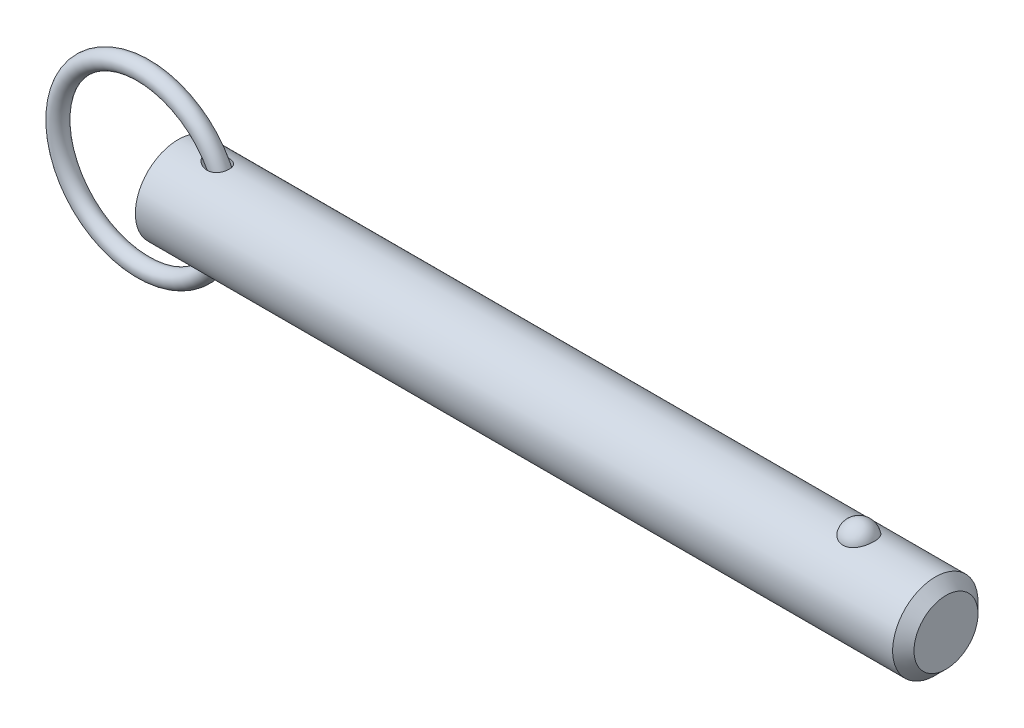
ISO-10303-21;
HEADER;
FILE_DESCRIPTION(('STEP AP214'),'2;1');
FILE_NAME('part.step','',(''),(''),'','','');
FILE_SCHEMA(('AUTOMOTIVE_DESIGN { 1 0 10303 214 1 1 1 1 }'));
ENDSEC;
DATA;
#1=APPLICATION_CONTEXT('core data for automotive mechanical design processes');
#2=APPLICATION_PROTOCOL_DEFINITION('international standard','automotive_design',2000,#1);
#3=PRODUCT_CONTEXT('',#1,'mechanical');
#4=PRODUCT('Part','Part','',(#3));
#5=PRODUCT_RELATED_PRODUCT_CATEGORY('part','',(#4));
#6=PRODUCT_DEFINITION_FORMATION('','',#4);
#7=PRODUCT_DEFINITION_CONTEXT('part definition',#1,'design');
#8=PRODUCT_DEFINITION('design','',#6,#7);
#9=PRODUCT_DEFINITION_SHAPE('','',#8);
#10=(LENGTH_UNIT() NAMED_UNIT(*) SI_UNIT(.MILLI.,.METRE.));
#11=(NAMED_UNIT(*) PLANE_ANGLE_UNIT() SI_UNIT($,.RADIAN.));
#12=(NAMED_UNIT(*) SI_UNIT($,.STERADIAN.) SOLID_ANGLE_UNIT());
#13=UNCERTAINTY_MEASURE_WITH_UNIT(LENGTH_MEASURE(1.E-05),#10,'distance_accuracy_value','');
#14=(GEOMETRIC_REPRESENTATION_CONTEXT(3) GLOBAL_UNCERTAINTY_ASSIGNED_CONTEXT((#13)) GLOBAL_UNIT_ASSIGNED_CONTEXT((#10,
#11,#12)) REPRESENTATION_CONTEXT('',''));
#15=CARTESIAN_POINT('',(0.,0.,0.));
#16=DIRECTION('',(0.,0.,1.));
#17=DIRECTION('',(1.,0.,0.));
#18=AXIS2_PLACEMENT_3D('',#15,#16,#17);
#19=CARTESIAN_POINT('',(-6.46799987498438,0.,0.));
#20=DIRECTION('',(0.,0.,1.));
#21=DIRECTION('',(1.,0.,0.));
#22=AXIS2_PLACEMENT_3D('',#19,#20,#21);
#23=TOROIDAL_SURFACE('',#22,15.875,1.588);
#24=CARTESIAN_POINT('',(10.9950001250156,0.,0.));
#25=VERTEX_POINT('',#24);
#26=VERTEX_LOOP('',#25);
#27=FACE_BOUND('',#26,.T.);
#28=ADVANCED_FACE('P0_F12',(#27),#23,.T.);
#29=CLOSED_SHELL('',(#28));
#30=MANIFOLD_SOLID_BREP('P0_B1',#29);
#31=CARTESIAN_POINT('',(0.,0.,0.));
#32=DIRECTION('',(1.,0.,0.));
#33=DIRECTION('',(0.,0.,-1.));
#34=AXIS2_PLACEMENT_3D('',#31,#32,#33);
#35=CYLINDRICAL_SURFACE('',#34,7.94);
#36=CARTESIAN_POINT('',(5.37881269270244,7.8641200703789,-1.0950869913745));
#37=CARTESIAN_POINT('',(5.49078530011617,7.84653010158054,-1.22142628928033));
#38=CARTESIAN_POINT('',(5.61742164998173,7.82766483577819,-1.33478448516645));
#39=CARTESIAN_POINT('',(5.82155225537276,7.80005811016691,-1.48501770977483));
#40=CARTESIAN_POINT('',(5.89211597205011,7.79095331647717,-1.53186949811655));
#41=CARTESIAN_POINT('',(6.03726296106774,7.77331484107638,-1.61899652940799));
#42=CARTESIAN_POINT('',(6.11184478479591,7.76478095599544,-1.65927412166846));
#43=CARTESIAN_POINT('',(6.3183154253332,7.74290334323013,-1.75933205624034));
#44=CARTESIAN_POINT('',(6.45343253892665,7.73042593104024,-1.81276183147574));
#45=CARTESIAN_POINT('',(6.73017339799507,7.70966096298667,-1.89912673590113));
#46=CARTESIAN_POINT('',(6.87179099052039,7.70136953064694,-1.93208083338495));
#47=CARTESIAN_POINT('',(7.17522096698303,7.6896684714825,-1.97820987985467));
#48=CARTESIAN_POINT('',(7.33750100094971,7.68691980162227,-1.98871513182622));
#49=CARTESIAN_POINT('',(7.5799424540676,7.68880305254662,-1.98137951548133));
#50=CARTESIAN_POINT('',(7.66059155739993,7.69043175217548,-1.97508575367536));
#51=CARTESIAN_POINT('',(7.82077465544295,7.69570110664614,-1.95445819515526));
#52=CARTESIAN_POINT('',(7.90030910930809,7.69934090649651,-1.94012781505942));
#53=CARTESIAN_POINT('',(8.092800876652,7.71066069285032,-1.89475688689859));
#54=CARTESIAN_POINT('',(8.2046520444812,7.71942251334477,-1.85909462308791));
#55=CARTESIAN_POINT('',(8.42059371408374,7.74035594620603,-1.7699066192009));
#56=CARTESIAN_POINT('',(8.52468939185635,7.75252525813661,-1.7163929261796));
#57=CARTESIAN_POINT('',(8.72211003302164,7.77903750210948,-1.59192358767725));
#58=CARTESIAN_POINT('',(8.81539818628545,7.79338749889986,-1.52091076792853));
#59=CARTESIAN_POINT('',(8.98759177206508,7.8225086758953,-1.36321590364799));
#60=CARTESIAN_POINT('',(9.06649712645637,7.83727985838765,-1.27653377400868));
#61=CARTESIAN_POINT('',(9.20311499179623,7.86453692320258,-1.09567667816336));
#62=CARTESIAN_POINT('',(9.26180839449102,7.8771064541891,-1.00225329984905));
#63=CARTESIAN_POINT('',(9.36257622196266,7.89954213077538,-0.806547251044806));
#64=CARTESIAN_POINT('',(9.40465301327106,7.9094086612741,-0.704265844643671));
#65=CARTESIAN_POINT('',(9.47062404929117,7.92520709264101,-0.495461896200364));
#66=CARTESIAN_POINT('',(9.49478817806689,7.9311972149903,-0.38902885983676));
#67=CARTESIAN_POINT('',(9.52544004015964,7.93883641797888,-0.17349446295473));
#68=CARTESIAN_POINT('',(9.53192786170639,7.94048552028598,-0.0643931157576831));
#69=CARTESIAN_POINT('',(9.52707996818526,7.93926454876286,0.153487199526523));
#70=CARTESIAN_POINT('',(9.51572796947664,7.93639034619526,0.262265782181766));
#71=CARTESIAN_POINT('',(9.47542322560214,7.92642470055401,0.47631311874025));
#72=CARTESIAN_POINT('',(9.44647056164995,7.91933327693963,0.581581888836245));
#73=CARTESIAN_POINT('',(9.37164011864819,7.90170355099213,0.785602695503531));
#74=CARTESIAN_POINT('',(9.32576415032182,7.89116561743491,0.884355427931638));
#75=CARTESIAN_POINT('',(9.21823065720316,7.8677977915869,1.07254831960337));
#76=CARTESIAN_POINT('',(9.15657431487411,7.85496807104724,1.16198917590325));
#77=CARTESIAN_POINT('',(9.01919194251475,7.82843688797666,1.32903649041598));
#78=CARTESIAN_POINT('',(8.94347744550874,7.81473614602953,1.40665255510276));
#79=CARTESIAN_POINT('',(8.78012086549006,7.7879321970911,1.5481977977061));
#80=CARTESIAN_POINT('',(8.69247914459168,7.77482897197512,1.61212739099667));
#81=CARTESIAN_POINT('',(8.5064231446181,7.75037063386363,1.72592270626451));
#82=CARTESIAN_POINT('',(8.40786430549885,7.73904540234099,1.77555777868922));
#83=CARTESIAN_POINT('',(8.20398708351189,7.71943979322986,1.85894844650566));
#84=CARTESIAN_POINT('',(8.09866701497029,7.7111601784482,1.89270006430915));
#85=CARTESIAN_POINT('',(7.87703213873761,7.69782475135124,1.94625652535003));
#86=CARTESIAN_POINT('',(7.76044899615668,7.69301557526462,1.96500324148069));
#87=CARTESIAN_POINT('',(7.5257425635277,7.68770484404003,1.98567257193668));
#88=CARTESIAN_POINT('',(7.40761868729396,7.68720497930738,1.98758858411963));
#89=CARTESIAN_POINT('',(7.15639592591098,7.69044495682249,1.97502233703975));
#90=CARTESIAN_POINT('',(7.02341871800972,7.69476380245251,1.9583009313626));
#91=CARTESIAN_POINT('',(6.76125891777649,7.70776394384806,1.90648094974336));
#92=CARTESIAN_POINT('',(6.63208047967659,7.71644984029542,1.87136299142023));
#93=CARTESIAN_POINT('',(6.35978215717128,7.73875442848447,1.77707737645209));
#94=CARTESIAN_POINT('',(6.2177212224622,7.75293863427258,1.71496895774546));
#95=CARTESIAN_POINT('',(5.94559201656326,7.78383102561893,1.56880760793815));
#96=CARTESIAN_POINT('',(5.81552062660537,7.80053855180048,1.48476040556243));
#97=CARTESIAN_POINT('',(5.60081087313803,7.83035955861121,1.31701356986));
#98=CARTESIAN_POINT('',(5.51265224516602,7.84340226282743,1.23780647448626));
#99=CARTESIAN_POINT('',(5.34976240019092,7.86852524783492,1.06647953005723));
#100=CARTESIAN_POINT('',(5.27500719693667,7.88060722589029,0.974383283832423));
#101=CARTESIAN_POINT('',(5.15877594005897,7.89990441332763,0.800548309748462));
#102=CARTESIAN_POINT('',(5.11360209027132,7.90759876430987,0.721348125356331));
#103=CARTESIAN_POINT('',(5.03655060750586,7.92090267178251,0.556518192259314));
#104=CARTESIAN_POINT('',(5.00466157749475,7.92651401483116,0.470894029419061));
#105=CARTESIAN_POINT('',(4.95653766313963,7.93503671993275,0.294356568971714));
#106=CARTESIAN_POINT('',(4.94043621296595,7.93792505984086,0.203404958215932));
#107=CARTESIAN_POINT('',(4.92605720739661,7.94050250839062,0.0200631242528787));
#108=CARTESIAN_POINT('',(4.92776929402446,7.9401934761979,-0.0723262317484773));
#109=CARTESIAN_POINT('',(4.94742735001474,7.93667454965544,-0.243250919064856));
#110=CARTESIAN_POINT('',(4.96327131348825,7.93384031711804,-0.322048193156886));
#111=CARTESIAN_POINT('',(5.00707570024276,7.92609115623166,-0.476058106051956));
#112=CARTESIAN_POINT('',(5.03503965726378,7.92117562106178,-0.55126969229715));
#113=CARTESIAN_POINT('',(5.10737112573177,7.90866290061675,-0.709995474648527));
#114=CARTESIAN_POINT('',(5.15379379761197,7.90074105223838,-0.792541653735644));
#115=CARTESIAN_POINT('',(5.25820836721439,7.88338732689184,-0.949781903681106));
#116=CARTESIAN_POINT('',(5.31621941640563,7.87395295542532,-1.02446265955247));
#117=CARTESIAN_POINT('',(5.37881269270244,7.8641200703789,-1.0950869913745));
#118=B_SPLINE_CURVE_WITH_KNOTS('',3,(#36,#37,#38,#39,#40,#41,#42,#43,#44,#45,#46,#47,#48,#49,
#50,#51,#52,#53,#54,#55,#56,#57,#58,#59,#60,#61,#62,#63,#64,#65,#66,#67,#68,#69,#70,#71,#72,#73,
#74,#75,#76,#77,#78,#79,#80,#81,#82,#83,#84,#85,#86,#87,#88,#89,#90,#91,#92,#93,#94,#95,#96,#97,
#98,#99,#100,#101,#102,#103,#104,#105,#106,#107,#108,#109,#110,#111,#112,#113,#114,#115,#116,
#117),.UNSPECIFIED.,.T.,.F.,(4,2,2,2,2,2,2,2,2,2,2,2,2,2,2,2,2,2,2,2,2,2,2,2,2,2,2,2,2,2,2,2,2,
2,2,2,2,2,2,2,4),(0.,0.508599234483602,0.763935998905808,1.01918131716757,1.45492798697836,
1.89027038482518,2.37502798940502,2.61739702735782,2.8596631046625,3.21120678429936,
3.56251370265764,3.91498401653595,4.26745624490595,4.59897839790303,4.93045331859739,
5.25682643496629,5.58319792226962,5.909867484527,6.23653553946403,6.56316865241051,
6.88977729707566,7.21611917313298,7.54245114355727,7.87378632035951,8.20520442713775,
8.55832700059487,8.91158808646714,9.31234018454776,9.71351536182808,10.1786231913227,
10.6436096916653,11.0001264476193,11.3559986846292,11.6294791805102,11.9027245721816,
12.1782599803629,12.4536351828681,12.693828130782,12.9340911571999,13.2179277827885,
13.5022374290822),.UNSPECIFIED.);
#119=CARTESIAN_POINT('',(5.37881269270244,7.8641200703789,-1.0950869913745));
#120=VERTEX_POINT('',#119);
#121=EDGE_CURVE('P1_E40',#120,#120,#118,.T.);
#122=ORIENTED_EDGE('',*,*,#121,.T.);
#123=EDGE_LOOP('',(#122));
#124=FACE_BOUND('',#123,.T.);
#125=CARTESIAN_POINT('',(140.895,0.,0.));
#126=DIRECTION('',(1.,0.,0.));
#127=DIRECTION('',(0.,0.,-1.));
#128=AXIS2_PLACEMENT_3D('',#125,#126,#127);
#129=CIRCLE('',#128,7.94);
#130=CARTESIAN_POINT('',(140.895,0.,-7.94));
#131=VERTEX_POINT('',#130);
#132=EDGE_CURVE('P1_E25',#131,#131,#129,.T.);
#133=ORIENTED_EDGE('',*,*,#132,.F.);
#134=EDGE_LOOP('',(#133));
#135=FACE_BOUND('',#134,.T.);
#136=CARTESIAN_POINT('',(0.,0.,0.));
#137=DIRECTION('',(1.,0.,0.));
#138=DIRECTION('',(0.,0.,-1.));
#139=AXIS2_PLACEMENT_3D('',#136,#137,#138);
#140=CIRCLE('',#139,7.94);
#141=CARTESIAN_POINT('',(0.,0.,-7.94));
#142=VERTEX_POINT('',#141);
#143=EDGE_CURVE('P1_E9',#142,#142,#140,.T.);
#144=ORIENTED_EDGE('',*,*,#143,.T.);
#145=EDGE_LOOP('',(#144));
#146=FACE_BOUND('',#145,.T.);
#147=CARTESIAN_POINT('',(126.664907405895,7.37767842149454,2.93486986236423));
#148=CARTESIAN_POINT('',(126.512749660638,7.3776732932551,2.93487505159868));
#149=CARTESIAN_POINT('',(126.360632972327,7.38258419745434,2.92262454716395));
#150=CARTESIAN_POINT('',(126.060928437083,7.40163229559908,2.87404196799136));
#151=CARTESIAN_POINT('',(125.913339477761,7.41576720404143,2.83771585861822));
#152=CARTESIAN_POINT('',(125.627018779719,7.45161576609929,2.74218769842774));
#153=CARTESIAN_POINT('',(125.488274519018,7.47331841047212,2.68301886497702));
#154=CARTESIAN_POINT('',(125.222882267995,7.52194082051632,2.54350967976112));
#155=CARTESIAN_POINT('',(125.096236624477,7.54886159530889,2.46316523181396));
#156=CARTESIAN_POINT('',(124.854534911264,7.60594671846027,2.28090375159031));
#157=CARTESIAN_POINT('',(124.739906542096,7.63618114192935,2.17844211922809));
#158=CARTESIAN_POINT('',(124.528878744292,7.69614046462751,1.95608495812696));
#159=CARTESIAN_POINT('',(124.432482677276,7.72586526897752,1.83618622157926));
#160=CARTESIAN_POINT('',(124.255938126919,7.78314821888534,1.57628086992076));
#161=CARTESIAN_POINT('',(124.176707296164,7.81055035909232,1.43561546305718));
#162=CARTESIAN_POINT('',(124.041797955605,7.85879631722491,1.14236334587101));
#163=CARTESIAN_POINT('',(123.986121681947,7.87963951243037,0.989775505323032));
#164=CARTESIAN_POINT('',(123.89881215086,7.91289645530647,0.674619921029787));
#165=CARTESIAN_POINT('',(123.86753090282,7.92518652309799,0.511941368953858));
#166=CARTESIAN_POINT('',(123.830975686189,7.93958930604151,0.18324773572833));
#167=CARTESIAN_POINT('',(123.825701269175,7.94170219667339,0.0172327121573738));
#168=CARTESIAN_POINT('',(123.841231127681,7.93554931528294,-0.312672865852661));
#169=CARTESIAN_POINT('',(123.861925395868,7.92732732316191,-0.47656943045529));
#170=CARTESIAN_POINT('',(123.92878655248,7.90141534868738,-0.798305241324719));
#171=CARTESIAN_POINT('',(123.974953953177,7.88372517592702,-0.956144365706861));
#172=CARTESIAN_POINT('',(124.091898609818,7.84066230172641,-1.2615207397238));
#173=CARTESIAN_POINT('',(124.162704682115,7.81528060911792,-1.40904568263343));
#174=CARTESIAN_POINT('',(124.327478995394,7.7594867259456,-1.68950598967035));
#175=CARTESIAN_POINT('',(124.421448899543,7.72907417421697,-1.82244030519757));
#176=CARTESIAN_POINT('',(124.630839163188,7.66640424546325,-2.07032792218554));
#177=CARTESIAN_POINT('',(124.746315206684,7.63414223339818,-2.1852330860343));
#178=CARTESIAN_POINT('',(124.9959006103,7.57149681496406,-2.39329737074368));
#179=CARTESIAN_POINT('',(125.130008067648,7.54111321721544,-2.48645870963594));
#180=CARTESIAN_POINT('',(125.410111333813,7.48650742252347,-2.64628132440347));
#181=CARTESIAN_POINT('',(125.555760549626,7.46215900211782,-2.71350554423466));
#182=CARTESIAN_POINT('',(125.857425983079,7.42171253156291,-2.82226614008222));
#183=CARTESIAN_POINT('',(126.013438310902,7.40561140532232,-2.86381209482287));
#184=CARTESIAN_POINT('',(126.322970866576,7.3842679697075,-2.9183907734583));
#185=CARTESIAN_POINT('',(126.476222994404,7.37852109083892,-2.93275024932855));
#186=CARTESIAN_POINT('',(126.783070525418,7.37700973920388,-2.93655208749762));
#187=CARTESIAN_POINT('',(126.936665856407,7.38124333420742,-2.92599927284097));
#188=CARTESIAN_POINT('',(127.234990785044,7.39890635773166,-2.88102897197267));
#189=CARTESIAN_POINT('',(127.379848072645,7.41205491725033,-2.84733999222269));
#190=CARTESIAN_POINT('',(127.66164329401,7.445801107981,-2.75788206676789));
#191=CARTESIAN_POINT('',(127.798580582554,7.46639934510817,-2.70211132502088));
#192=CARTESIAN_POINT('',(128.064061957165,7.51339098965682,-2.56858908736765));
#193=CARTESIAN_POINT('',(128.192354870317,7.53990200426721,-2.4903806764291));
#194=CARTESIAN_POINT('',(128.434244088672,7.59569503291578,-2.31462737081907));
#195=CARTESIAN_POINT('',(128.547837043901,7.6249776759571,-2.21707808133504));
#196=CARTESIAN_POINT('',(128.76322156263,7.68489473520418,-1.99982049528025));
#197=CARTESIAN_POINT('',(128.864148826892,7.71552419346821,-1.87925337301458));
#198=CARTESIAN_POINT('',(129.045186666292,7.77353016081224,-1.6226882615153));
#199=CARTESIAN_POINT('',(129.125293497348,7.80090608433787,-1.48668750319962));
#200=CARTESIAN_POINT('',(129.265361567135,7.85047992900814,-1.1981841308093));
#201=CARTESIAN_POINT('',(129.324587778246,7.87248183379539,-1.04529016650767));
#202=CARTESIAN_POINT('',(129.417982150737,7.90785114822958,-0.731080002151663));
#203=CARTESIAN_POINT('',(129.452149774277,7.92121837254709,-0.569763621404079));
#204=CARTESIAN_POINT('',(129.494795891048,7.93797834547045,-0.242812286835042));
#205=CARTESIAN_POINT('',(129.503204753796,7.94134405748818,-0.0771668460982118));
#206=CARTESIAN_POINT('',(129.493962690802,7.93767937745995,0.25327690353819));
#207=CARTESIAN_POINT('',(129.476312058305,7.93064910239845,0.41807522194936));
#208=CARTESIAN_POINT('',(129.415424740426,7.90695571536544,0.741525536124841));
#209=CARTESIAN_POINT('',(129.372281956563,7.8903279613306,0.900197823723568));
#210=CARTESIAN_POINT('',(129.26135358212,7.84916386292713,1.20759654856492));
#211=CARTESIAN_POINT('',(129.19356656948,7.82462706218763,1.35632241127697));
#212=CARTESIAN_POINT('',(129.034371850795,7.7700669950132,1.64032869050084));
#213=CARTESIAN_POINT('',(128.942861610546,7.74002008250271,1.77554712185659));
#214=CARTESIAN_POINT('',(128.738296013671,7.67774175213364,2.02800648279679));
#215=CARTESIAN_POINT('',(128.625241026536,7.64551037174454,2.14524772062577));
#216=CARTESIAN_POINT('',(128.380831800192,7.58265895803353,2.35778002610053));
#217=CARTESIAN_POINT('',(128.249583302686,7.55203092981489,2.45319004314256));
#218=CARTESIAN_POINT('',(127.971601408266,7.49579792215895,2.61999897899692));
#219=CARTESIAN_POINT('',(127.824867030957,7.47019326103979,2.69139637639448));
#220=CARTESIAN_POINT('',(127.512947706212,7.42622216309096,2.8105324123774));
#221=CARTESIAN_POINT('',(127.347220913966,7.40825002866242,2.85700910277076));
#222=CARTESIAN_POINT('',(127.009279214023,7.38398348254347,2.9191685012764));
#223=CARTESIAN_POINT('',(126.83706702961,7.3776842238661,2.93486399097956));
#224=CARTESIAN_POINT('',(126.664907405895,7.37767842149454,2.93486986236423));
#225=B_SPLINE_CURVE_WITH_KNOTS('',3,(#147,#148,#149,#150,#151,#152,#153,#154,#155,#156,#157,
#158,#159,#160,#161,#162,#163,#164,#165,#166,#167,#168,#169,#170,#171,#172,#173,#174,#175,#176,
#177,#178,#179,#180,#181,#182,#183,#184,#185,#186,#187,#188,#189,#190,#191,#192,#193,#194,#195,
#196,#197,#198,#199,#200,#201,#202,#203,#204,#205,#206,#207,#208,#209,#210,#211,#212,#213,#214,
#215,#216,#217,#218,#219,#220,#221,#222,#223,#224),.UNSPECIFIED.,.T.,.F.,(4,2,2,2,2,2,2,2,2,2,2,
2,2,2,2,2,2,2,2,2,2,2,2,2,2,2,2,2,2,2,2,2,2,2,2,2,2,2,4),(0.,0.455841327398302,
0.911569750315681,1.36663794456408,1.8217942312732,2.28978983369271,2.75787163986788,
3.24685368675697,3.73588214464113,4.23184282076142,4.72779494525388,5.22165321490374,
5.71552141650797,6.20996917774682,6.7044524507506,7.20023431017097,7.69596557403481,
8.18023418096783,8.66432203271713,9.12410697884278,9.58380291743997,10.0296503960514,
10.4755341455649,10.9312349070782,11.3870393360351,11.8654416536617,12.3439299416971,
12.8378875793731,13.3318558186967,13.8271581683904,14.3224549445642,14.8159385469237,
15.3094506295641,15.8051323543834,16.3008055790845,16.7937101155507,17.2866458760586,
17.8026240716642,18.3183879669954),.UNSPECIFIED.);
#226=CARTESIAN_POINT('',(126.664907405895,7.37767842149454,2.93486986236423));
#227=VERTEX_POINT('',#226);
#228=EDGE_CURVE('P1_E34',#227,#227,#225,.T.);
#229=ORIENTED_EDGE('',*,*,#228,.T.);
#230=EDGE_LOOP('',(#229));
#231=FACE_BOUND('',#230,.T.);
#232=CARTESIAN_POINT('',(5.37881269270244,-7.8641200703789,-1.0950869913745));
#233=CARTESIAN_POINT('',(5.31532711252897,-7.87409326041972,-1.02345575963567));
#234=CARTESIAN_POINT('',(5.25654962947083,-7.88365715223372,-0.947641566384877));
#235=CARTESIAN_POINT('',(5.15093536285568,-7.90122221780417,-0.787865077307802));
#236=CARTESIAN_POINT('',(5.10408931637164,-7.90922460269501,-0.703909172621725));
#237=CARTESIAN_POINT('',(5.02499142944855,-7.92292057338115,-0.5279916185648));
#238=CARTESIAN_POINT('',(4.99290048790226,-7.92858863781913,-0.435954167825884));
#239=CARTESIAN_POINT('',(4.94718343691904,-7.93670712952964,-0.247266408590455));
#240=CARTESIAN_POINT('',(4.93353142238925,-7.93916207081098,-0.150622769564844));
#241=CARTESIAN_POINT('',(4.92669426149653,-7.94038957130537,0.0306459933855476));
#242=CARTESIAN_POINT('',(4.93105622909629,-7.93960347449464,0.115182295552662));
#243=CARTESIAN_POINT('',(4.95441758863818,-7.93542535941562,0.2821331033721));
#244=CARTESIAN_POINT('',(4.97342060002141,-7.93203269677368,0.364547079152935));
#245=CARTESIAN_POINT('',(5.02337664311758,-7.92322764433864,0.521528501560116));
#246=CARTESIAN_POINT('',(5.0537758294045,-7.91790920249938,0.596281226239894));
#247=CARTESIAN_POINT('',(5.12468720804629,-7.90571364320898,0.740640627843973));
#248=CARTESIAN_POINT('',(5.16520358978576,-7.89883588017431,0.810245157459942));
#249=CARTESIAN_POINT('',(5.27792634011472,-7.88012470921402,0.97862022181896));
#250=CARTESIAN_POINT('',(5.35563200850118,-7.86757912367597,1.07363778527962));
#251=CARTESIAN_POINT('',(5.52523836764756,-7.84150676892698,1.24994147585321));
#252=CARTESIAN_POINT('',(5.61717506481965,-7.82797755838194,1.33119164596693));
#253=CARTESIAN_POINT('',(5.83913717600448,-7.79742756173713,1.50104748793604));
#254=CARTESIAN_POINT('',(5.97257429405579,-7.78050347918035,1.58521567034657));
#255=CARTESIAN_POINT('',(6.25160600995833,-7.74942135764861,1.73078109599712));
#256=CARTESIAN_POINT('',(6.39720857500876,-7.73526515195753,1.79216327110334));
#257=CARTESIAN_POINT('',(6.69793322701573,-7.7116170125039,1.89134478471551));
#258=CARTESIAN_POINT('',(6.85312134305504,-7.70216275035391,1.92895428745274));
#259=CARTESIAN_POINT('',(7.16781951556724,-7.68988337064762,1.97736316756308));
#260=CARTESIAN_POINT('',(7.32732244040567,-7.68704791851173,1.98820434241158));
#261=CARTESIAN_POINT('',(7.61290770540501,-7.68890797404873,1.98097687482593));
#262=CARTESIAN_POINT('',(7.73913797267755,-7.69217875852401,1.96837928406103));
#263=CARTESIAN_POINT('',(7.98774248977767,-7.70364253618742,1.92303262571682));
#264=CARTESIAN_POINT('',(8.11011880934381,-7.71183283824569,1.89029457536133));
#265=CARTESIAN_POINT('',(8.34766306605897,-7.73253074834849,1.80375920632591));
#266=CARTESIAN_POINT('',(8.46278682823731,-7.74506226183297,1.74984505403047));
#267=CARTESIAN_POINT('',(8.68062682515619,-7.77294147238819,1.62149891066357));
#268=CARTESIAN_POINT('',(8.78334736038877,-7.78828818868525,1.54707406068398));
#269=CARTESIAN_POINT('',(8.9627595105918,-7.81808719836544,1.38814746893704));
#270=CARTESIAN_POINT('',(9.04102925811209,-7.83247448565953,1.30540890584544));
#271=CARTESIAN_POINT('',(9.18176824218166,-7.86008608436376,1.1272733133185));
#272=CARTESIAN_POINT('',(9.24424163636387,-7.87331070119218,1.03187962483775));
#273=CARTESIAN_POINT('',(9.34924815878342,-7.89649032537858,0.83568428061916));
#274=CARTESIAN_POINT('',(9.39252490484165,-7.90656172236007,0.735293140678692));
#275=CARTESIAN_POINT('',(9.46188913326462,-7.92307290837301,0.528458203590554));
#276=CARTESIAN_POINT('',(9.48797767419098,-7.92951292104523,0.422014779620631));
#277=CARTESIAN_POINT('',(9.52228670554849,-7.93804067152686,0.206589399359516));
#278=CARTESIAN_POINT('',(9.53058328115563,-7.94014694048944,0.0976202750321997));
#279=CARTESIAN_POINT('',(9.52935292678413,-7.93983698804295,-0.120212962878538));
#280=CARTESIAN_POINT('',(9.51982577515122,-7.93742071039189,-0.229077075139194));
#281=CARTESIAN_POINT('',(9.48313466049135,-7.92831916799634,-0.443751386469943));
#282=CARTESIAN_POINT('',(9.45594838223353,-7.92162850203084,-0.549557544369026));
#283=CARTESIAN_POINT('',(9.38454658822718,-7.90469917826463,-0.754954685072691));
#284=CARTESIAN_POINT('',(9.34033171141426,-7.89446065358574,-0.854545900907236));
#285=CARTESIAN_POINT('',(9.23602927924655,-7.87157146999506,-1.04456732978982));
#286=CARTESIAN_POINT('',(9.17596171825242,-7.85892385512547,-1.13500888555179));
#287=CARTESIAN_POINT('',(9.0415343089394,-7.83259746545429,-1.30436780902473));
#288=CARTESIAN_POINT('',(8.96717562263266,-7.81891877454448,-1.38328611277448));
#289=CARTESIAN_POINT('',(8.80603455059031,-7.79196869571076,-1.52782923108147));
#290=CARTESIAN_POINT('',(8.71921490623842,-7.77869867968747,-1.59341269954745));
#291=CARTESIAN_POINT('',(8.53589430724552,-7.7539823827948,-1.7096493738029));
#292=CARTESIAN_POINT('',(8.43939269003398,-7.74253622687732,-1.76030155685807));
#293=CARTESIAN_POINT('',(8.23614706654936,-7.72219212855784,-1.84754820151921));
#294=CARTESIAN_POINT('',(8.1291686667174,-7.71339202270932,-1.88361685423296));
#295=CARTESIAN_POINT('',(7.91082287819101,-7.69955300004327,-1.93940887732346));
#296=CARTESIAN_POINT('',(7.79945379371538,-7.69451555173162,-1.95912586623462));
#297=CARTESIAN_POINT('',(7.56409927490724,-7.6881073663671,-1.98413612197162));
#298=CARTESIAN_POINT('',(7.43993744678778,-7.68713944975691,-1.98784574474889));
#299=CARTESIAN_POINT('',(7.19239878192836,-7.68969629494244,-1.97792309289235));
#300=CARTESIAN_POINT('',(7.06902225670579,-7.69322274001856,-1.96428432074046));
#301=CARTESIAN_POINT('',(6.80624991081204,-7.70498367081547,-1.91768089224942));
#302=CARTESIAN_POINT('',(6.66736121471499,-7.71386737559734,-1.88203087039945));
#303=CARTESIAN_POINT('',(6.39625444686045,-7.73551250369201,-1.79098714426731));
#304=CARTESIAN_POINT('',(6.26404857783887,-7.74828074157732,-1.73555871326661));
#305=CARTESIAN_POINT('',(6.06559048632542,-7.77003865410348,-1.63446133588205));
#306=CARTESIAN_POINT('',(5.99591479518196,-7.77821880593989,-1.59522999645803));
#307=CARTESIAN_POINT('',(5.86025875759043,-7.79503524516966,-1.51091846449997));
#308=CARTESIAN_POINT('',(5.79427944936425,-7.8036716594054,-1.46583664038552));
#309=CARTESIAN_POINT('',(5.60322733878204,-7.82978128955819,-1.3219827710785));
#310=CARTESIAN_POINT('',(5.4844964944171,-7.84751780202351,-1.21433077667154));
#311=CARTESIAN_POINT('',(5.37881269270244,-7.8641200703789,-1.0950869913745));
#312=B_SPLINE_CURVE_WITH_KNOTS('',3,(#232,#233,#234,#235,#236,#237,#238,#239,#240,#241,#242,
#243,#244,#245,#246,#247,#248,#249,#250,#251,#252,#253,#254,#255,#256,#257,#258,#259,#260,#261,
#262,#263,#264,#265,#266,#267,#268,#269,#270,#271,#272,#273,#274,#275,#276,#277,#278,#279,#280,
#281,#282,#283,#284,#285,#286,#287,#288,#289,#290,#291,#292,#293,#294,#295,#296,#297,#298,#299,
#300,#301,#302,#303,#304,#305,#306,#307,#308,#309,#310,#311),.UNSPECIFIED.,.T.,.F.,(4,2,2,2,2,2,
2,2,2,2,2,2,2,2,2,2,2,2,2,2,2,2,2,2,2,2,2,2,2,2,2,2,2,2,2,2,2,2,2,4),(0.,0.288363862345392,
0.576503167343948,0.867714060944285,1.15851540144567,1.41111828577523,1.66378363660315,
1.90549406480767,2.1473047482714,2.51540453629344,2.88445136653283,3.35805159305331,
3.83196445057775,4.30961543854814,4.78652012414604,5.16565662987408,5.54458592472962,
5.92563591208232,6.30655339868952,6.64920782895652,6.99177197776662,7.31956587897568,
7.64733959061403,7.97370879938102,8.30008206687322,8.62686856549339,8.95364280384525,
9.28000684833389,9.60634436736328,9.93367879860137,10.261035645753,10.59932199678,
10.9377403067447,11.308967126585,11.6803330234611,12.1096921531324,12.5398088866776,
12.7806650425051,13.0215885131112,13.5016249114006),.UNSPECIFIED.);
#313=CARTESIAN_POINT('',(5.37881269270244,-7.8641200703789,-1.0950869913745));
#314=VERTEX_POINT('',#313);
#315=EDGE_CURVE('P1_E17',#314,#314,#312,.T.);
#316=ORIENTED_EDGE('',*,*,#315,.T.);
#317=EDGE_LOOP('',(#316));
#318=FACE_BOUND('',#317,.T.);
#319=ADVANCED_FACE('P1_F13',(#124,#135,#146,#231,#318),#35,.T.);
#320=CARTESIAN_POINT('',(0.,0.,0.));
#321=DIRECTION('',(-1.,0.,0.));
#322=DIRECTION('',(0.,0.,1.));
#323=AXIS2_PLACEMENT_3D('',#320,#321,#322);
#324=PLANE('',#323);
#325=ORIENTED_EDGE('',*,*,#143,.F.);
#326=EDGE_LOOP('',(#325));
#327=FACE_BOUND('',#326,.T.);
#328=ADVANCED_FACE('P1_F15',(#327),#324,.T.);
#329=CARTESIAN_POINT('',(142.88,0.,0.));
#330=DIRECTION('',(-1.,0.,0.));
#331=DIRECTION('',(0.,0.,1.));
#332=AXIS2_PLACEMENT_3D('',#329,#330,#331);
#333=CONICAL_SURFACE('',#332,5.95500000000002,0.785398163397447);
#334=ORIENTED_EDGE('',*,*,#132,.T.);
#335=EDGE_LOOP('',(#334));
#336=FACE_BOUND('',#335,.T.);
#337=CARTESIAN_POINT('',(142.88,0.,0.));
#338=DIRECTION('',(1.,0.,0.));
#339=DIRECTION('',(0.,0.,-1.));
#340=AXIS2_PLACEMENT_3D('',#337,#338,#339);
#341=CIRCLE('',#340,5.95500000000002);
#342=CARTESIAN_POINT('',(142.88,0.,-5.95500000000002));
#343=VERTEX_POINT('',#342);
#344=EDGE_CURVE('P1_E30',#343,#343,#341,.T.);
#345=ORIENTED_EDGE('',*,*,#344,.F.);
#346=EDGE_LOOP('',(#345));
#347=FACE_BOUND('',#346,.T.);
#348=ADVANCED_FACE('P1_F55',(#336,#347),#333,.T.);
#349=CARTESIAN_POINT('',(142.88,5.95500000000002,0.));
#350=DIRECTION('',(1.,0.,0.));
#351=DIRECTION('',(0.,0.,-1.));
#352=AXIS2_PLACEMENT_3D('',#349,#350,#351);
#353=PLANE('',#352);
#354=ORIENTED_EDGE('',*,*,#344,.T.);
#355=EDGE_LOOP('',(#354));
#356=FACE_BOUND('',#355,.T.);
#357=ADVANCED_FACE('P1_F51',(#356),#353,.T.);
#358=CARTESIAN_POINT('',(126.664907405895,7.146,0.));
#359=DIRECTION('',(-1.,0.,0.));
#360=DIRECTION('',(0.,1.,0.));
#361=AXIS2_PLACEMENT_3D('',#358,#359,#360);
#362=SPHERICAL_SURFACE('',#361,2.944);
#363=ORIENTED_EDGE('',*,*,#228,.F.);
#364=EDGE_LOOP('',(#363));
#365=FACE_BOUND('',#364,.T.);
#366=ADVANCED_FACE('P1_F46',(#365),#362,.T.);
#367=CARTESIAN_POINT('',(-6.46799987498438,0.,0.));
#368=DIRECTION('',(0.,0.,1.));
#369=DIRECTION('',(1.,0.,0.));
#370=AXIS2_PLACEMENT_3D('',#367,#368,#369);
#371=TOROIDAL_SURFACE('',#370,15.875,1.985);
#372=ORIENTED_EDGE('',*,*,#315,.F.);
#373=EDGE_LOOP('',(#372));
#374=FACE_BOUND('',#373,.T.);
#375=ORIENTED_EDGE('',*,*,#121,.F.);
#376=EDGE_LOOP('',(#375));
#377=FACE_BOUND('',#376,.T.);
#378=ADVANCED_FACE('P1_F50',(#374,#377),#371,.F.);
#379=CLOSED_SHELL('',(#319,#328,#348,#357,#366,#378));
#380=MANIFOLD_SOLID_BREP('P1_B1',#379);
#381=ADVANCED_BREP_SHAPE_REPRESENTATION('',(#18,#30,#380),#14);
#382=SHAPE_DEFINITION_REPRESENTATION(#9,#381);
ENDSEC;
END-ISO-10303-21;
